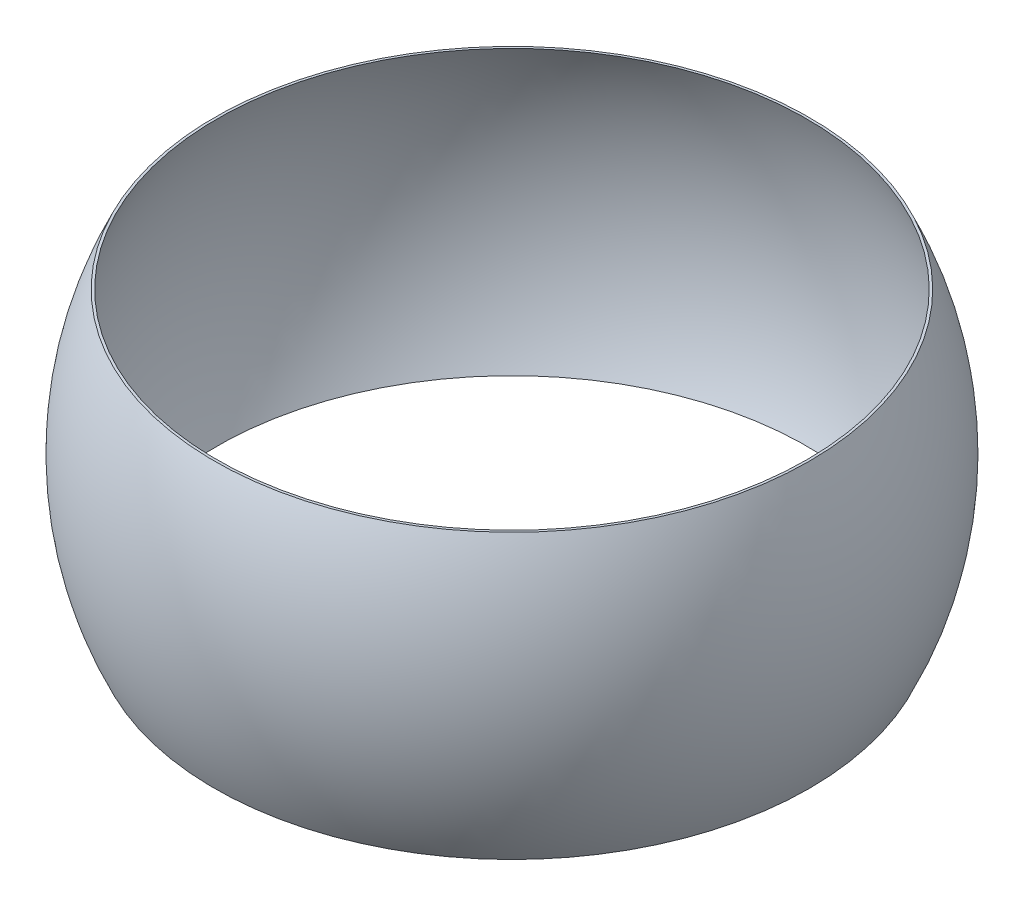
from build123d import *


with BuildPart() as part:
    # Sketch1 → Revolve1 (revolve)
    with BuildSketch(Plane.XY):
        with BuildLine():
            Line((6.742922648, 3.2385), (6.799234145, 3.2385))
            ThreePointArc((6.799234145, 3.2385), (7.5311, 0), (6.799234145, -3.2385))
            Line((6.799234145, -3.2385), (6.742922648, -3.2385))
            ThreePointArc((6.742922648, -3.2385), (7.4803, 0), (6.742922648, 3.2385))
        make_face()
    revolve(axis=Axis((0, 5.398217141, 0), (0, -1, 0)))


solid = part.part
